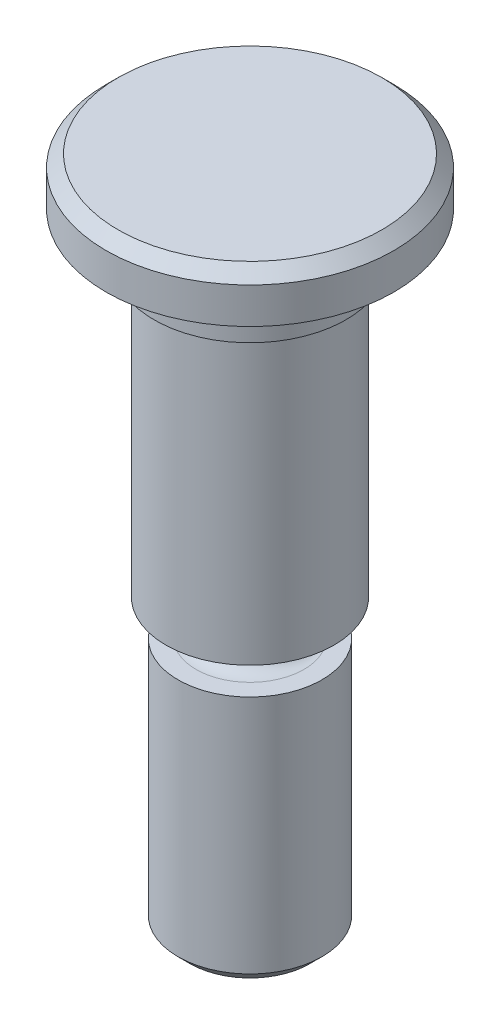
ISO-10303-21;
HEADER;
FILE_DESCRIPTION(('STEP AP214'),'2;1');
FILE_NAME('part.step','',(''),(''),'','','');
FILE_SCHEMA(('AUTOMOTIVE_DESIGN { 1 0 10303 214 1 1 1 1 }'));
ENDSEC;
DATA;
#1=APPLICATION_CONTEXT('core data for automotive mechanical design processes');
#2=APPLICATION_PROTOCOL_DEFINITION('international standard','automotive_design',2000,#1);
#3=PRODUCT_CONTEXT('',#1,'mechanical');
#4=PRODUCT('Part','Part','',(#3));
#5=PRODUCT_RELATED_PRODUCT_CATEGORY('part','',(#4));
#6=PRODUCT_DEFINITION_FORMATION('','',#4);
#7=PRODUCT_DEFINITION_CONTEXT('part definition',#1,'design');
#8=PRODUCT_DEFINITION('design','',#6,#7);
#9=PRODUCT_DEFINITION_SHAPE('','',#8);
#10=(LENGTH_UNIT() NAMED_UNIT(*) SI_UNIT(.MILLI.,.METRE.));
#11=(NAMED_UNIT(*) PLANE_ANGLE_UNIT() SI_UNIT($,.RADIAN.));
#12=(NAMED_UNIT(*) SI_UNIT($,.STERADIAN.) SOLID_ANGLE_UNIT());
#13=UNCERTAINTY_MEASURE_WITH_UNIT(LENGTH_MEASURE(1.E-05),#10,'distance_accuracy_value','');
#14=(GEOMETRIC_REPRESENTATION_CONTEXT(3) GLOBAL_UNCERTAINTY_ASSIGNED_CONTEXT((#13)) GLOBAL_UNIT_ASSIGNED_CONTEXT((#10,
#11,#12)) REPRESENTATION_CONTEXT('',''));
#15=CARTESIAN_POINT('',(0.,0.,0.));
#16=DIRECTION('',(0.,0.,1.));
#17=DIRECTION('',(1.,0.,0.));
#18=AXIS2_PLACEMENT_3D('',#15,#16,#17);
#19=CARTESIAN_POINT('',(0.,28.,-1.2490009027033E-13));
#20=DIRECTION('',(0.,-1.,0.));
#21=DIRECTION('',(0.,0.,-0.999999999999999));
#22=AXIS2_PLACEMENT_3D('',#19,#20,#21);
#23=PLANE('',#22);
#24=CARTESIAN_POINT('',(0.,28.,-1.2490009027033E-13));
#25=DIRECTION('',(0.,-1.,0.));
#26=DIRECTION('',(0.,0.,-0.999999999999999));
#27=AXIS2_PLACEMENT_3D('',#24,#25,#26);
#28=CIRCLE('',#27,5.49999999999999);
#29=CARTESIAN_POINT('',(0.,28.,-5.50000000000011));
#30=VERTEX_POINT('',#29);
#31=EDGE_CURVE('E44',#30,#30,#28,.F.);
#32=ORIENTED_EDGE('',*,*,#31,.T.);
#33=EDGE_LOOP('',(#32));
#34=FACE_BOUND('',#33,.T.);
#35=ADVANCED_FACE('F34',(#34),#23,.F.);
#36=CARTESIAN_POINT('',(0.,0.,0.));
#37=DIRECTION('',(0.,-1.,0.));
#38=DIRECTION('',(0.,0.,-0.999999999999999));
#39=AXIS2_PLACEMENT_3D('',#36,#37,#38);
#40=CYLINDRICAL_SURFACE('',#39,5.99999999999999);
#41=CARTESIAN_POINT('',(0.,27.5,-1.80411241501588E-13));
#42=DIRECTION('',(0.,-1.,0.));
#43=DIRECTION('',(0.,0.,-0.999999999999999));
#44=AXIS2_PLACEMENT_3D('',#41,#42,#43);
#45=CIRCLE('',#44,5.99999999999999);
#46=CARTESIAN_POINT('',(0.,27.5,-6.00000000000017));
#47=VERTEX_POINT('',#46);
#48=EDGE_CURVE('E49',#47,#47,#45,.T.);
#49=ORIENTED_EDGE('',*,*,#48,.T.);
#50=EDGE_LOOP('',(#49));
#51=FACE_BOUND('',#50,.T.);
#52=CARTESIAN_POINT('',(0.,26.,-1.80411241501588E-13));
#53=DIRECTION('',(0.,-1.,0.));
#54=DIRECTION('',(0.,0.,-0.999999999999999));
#55=AXIS2_PLACEMENT_3D('',#52,#53,#54);
#56=CIRCLE('',#55,5.99999999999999);
#57=CARTESIAN_POINT('',(0.,26.,-6.00000000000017));
#58=VERTEX_POINT('',#57);
#59=EDGE_CURVE('E54',#58,#58,#56,.T.);
#60=ORIENTED_EDGE('',*,*,#59,.F.);
#61=EDGE_LOOP('',(#60));
#62=FACE_BOUND('',#61,.T.);
#63=ADVANCED_FACE('F98',(#51,#62),#40,.T.);
#64=CARTESIAN_POINT('',(6.00000000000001,26.,0.));
#65=DIRECTION('',(0.,1.,0.));
#66=DIRECTION('',(0.,0.,0.999999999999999));
#67=AXIS2_PLACEMENT_3D('',#64,#65,#66);
#68=PLANE('',#67);
#69=CARTESIAN_POINT('',(0.,26.,-1.80411241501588E-13));
#70=DIRECTION('',(0.,-1.,0.));
#71=DIRECTION('',(0.,0.,-0.999999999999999));
#72=AXIS2_PLACEMENT_3D('',#69,#70,#71);
#73=CIRCLE('',#72,3.99999999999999);
#74=CARTESIAN_POINT('',(0.,26.,-4.00000000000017));
#75=VERTEX_POINT('',#74);
#76=EDGE_CURVE('E57',#75,#75,#73,.T.);
#77=ORIENTED_EDGE('',*,*,#76,.F.);
#78=EDGE_LOOP('',(#77));
#79=FACE_BOUND('',#78,.T.);
#80=ORIENTED_EDGE('',*,*,#59,.T.);
#81=EDGE_LOOP('',(#80));
#82=FACE_BOUND('',#81,.T.);
#83=ADVANCED_FACE('F103',(#79,#82),#68,.F.);
#84=CARTESIAN_POINT('',(0.,0.,0.));
#85=DIRECTION('',(0.,-1.,0.));
#86=DIRECTION('',(0.,0.,-0.999999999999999));
#87=AXIS2_PLACEMENT_3D('',#84,#85,#86);
#88=CYLINDRICAL_SURFACE('',#87,3.99999999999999);
#89=CARTESIAN_POINT('',(0.,24.,0.));
#90=DIRECTION('',(0.,-1.,0.));
#91=DIRECTION('',(0.,0.,-0.999999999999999));
#92=AXIS2_PLACEMENT_3D('',#89,#90,#91);
#93=CIRCLE('',#92,3.99999999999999);
#94=CARTESIAN_POINT('',(0.,24.,-4.));
#95=VERTEX_POINT('',#94);
#96=EDGE_CURVE('E60',#95,#95,#93,.T.);
#97=ORIENTED_EDGE('',*,*,#96,.F.);
#98=EDGE_LOOP('',(#97));
#99=FACE_BOUND('',#98,.T.);
#100=ORIENTED_EDGE('',*,*,#76,.T.);
#101=EDGE_LOOP('',(#100));
#102=FACE_BOUND('',#101,.T.);
#103=ADVANCED_FACE('F112',(#99,#102),#88,.T.);
#104=CARTESIAN_POINT('',(4.,24.,0.));
#105=DIRECTION('',(0.,1.,0.));
#106=DIRECTION('',(0.,0.,0.999999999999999));
#107=AXIS2_PLACEMENT_3D('',#104,#105,#106);
#108=PLANE('',#107);
#109=CARTESIAN_POINT('',(0.,24.,0.));
#110=DIRECTION('',(0.,-1.,0.));
#111=DIRECTION('',(0.,0.,-0.999999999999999));
#112=AXIS2_PLACEMENT_3D('',#109,#110,#111);
#113=CIRCLE('',#112,3.49999999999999);
#114=CARTESIAN_POINT('',(0.,24.,-3.5));
#115=VERTEX_POINT('',#114);
#116=EDGE_CURVE('E63',#115,#115,#113,.T.);
#117=ORIENTED_EDGE('',*,*,#116,.F.);
#118=EDGE_LOOP('',(#117));
#119=FACE_BOUND('',#118,.T.);
#120=ORIENTED_EDGE('',*,*,#96,.T.);
#121=EDGE_LOOP('',(#120));
#122=FACE_BOUND('',#121,.T.);
#123=ADVANCED_FACE('F93',(#119,#122),#108,.F.);
#124=CARTESIAN_POINT('',(0.,0.,0.));
#125=DIRECTION('',(0.,-1.,0.));
#126=DIRECTION('',(0.,0.,-0.999999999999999));
#127=AXIS2_PLACEMENT_3D('',#124,#125,#126);
#128=CYLINDRICAL_SURFACE('',#127,3.49999999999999);
#129=CARTESIAN_POINT('',(0.,12.,0.));
#130=DIRECTION('',(0.,-1.,0.));
#131=DIRECTION('',(0.,0.,-0.999999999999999));
#132=AXIS2_PLACEMENT_3D('',#129,#130,#131);
#133=CIRCLE('',#132,3.49999999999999);
#134=CARTESIAN_POINT('',(0.,12.,-3.49999999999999));
#135=VERTEX_POINT('',#134);
#136=EDGE_CURVE('E66',#135,#135,#133,.T.);
#137=ORIENTED_EDGE('',*,*,#136,.F.);
#138=EDGE_LOOP('',(#137));
#139=FACE_BOUND('',#138,.T.);
#140=ORIENTED_EDGE('',*,*,#116,.T.);
#141=EDGE_LOOP('',(#140));
#142=FACE_BOUND('',#141,.T.);
#143=ADVANCED_FACE('F84',(#139,#142),#128,.T.);
#144=CARTESIAN_POINT('',(3.49999999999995,12.,0.));
#145=DIRECTION('',(0.,1.,0.));
#146=DIRECTION('',(0.,0.,0.999999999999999));
#147=AXIS2_PLACEMENT_3D('',#144,#145,#146);
#148=PLANE('',#147);
#149=ORIENTED_EDGE('',*,*,#136,.T.);
#150=EDGE_LOOP('',(#149));
#151=FACE_BOUND('',#150,.T.);
#152=CARTESIAN_POINT('',(0.,12.,0.));
#153=DIRECTION('',(0.,-1.,0.));
#154=DIRECTION('',(0.,0.,-0.999999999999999));
#155=AXIS2_PLACEMENT_3D('',#152,#153,#154);
#156=CIRCLE('',#155,2.25);
#157=CARTESIAN_POINT('',(0.,12.,-2.25));
#158=VERTEX_POINT('',#157);
#159=EDGE_CURVE('E75',#158,#158,#156,.T.);
#160=ORIENTED_EDGE('',*,*,#159,.F.);
#161=EDGE_LOOP('',(#160));
#162=FACE_BOUND('',#161,.T.);
#163=ADVANCED_FACE('F81',(#151,#162),#148,.F.);
#164=CARTESIAN_POINT('',(0.,27.5,-1.80411241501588E-13));
#165=DIRECTION('',(0.,-1.,0.));
#166=DIRECTION('',(0.,0.,-0.999999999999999));
#167=AXIS2_PLACEMENT_3D('',#164,#165,#166);
#168=CONICAL_SURFACE('',#167,5.99999999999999,0.785398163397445);
#169=ORIENTED_EDGE('',*,*,#31,.F.);
#170=EDGE_LOOP('',(#169));
#171=FACE_BOUND('',#170,.T.);
#172=ORIENTED_EDGE('',*,*,#48,.F.);
#173=EDGE_LOOP('',(#172));
#174=FACE_BOUND('',#173,.T.);
#175=ADVANCED_FACE('F83',(#171,#174),#168,.T.);
#176=CARTESIAN_POINT('',(0.,11.25,0.));
#177=DIRECTION('',(0.,-1.,0.));
#178=DIRECTION('',(0.,0.,-0.999999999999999));
#179=AXIS2_PLACEMENT_3D('',#176,#177,#178);
#180=TOROIDAL_SURFACE('',#179,2.25,0.75);
#181=CARTESIAN_POINT('',(0.,10.5,0.));
#182=DIRECTION('',(0.,-1.,0.));
#183=DIRECTION('',(0.,0.,-0.999999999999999));
#184=AXIS2_PLACEMENT_3D('',#181,#182,#183);
#185=CIRCLE('',#184,2.25);
#186=CARTESIAN_POINT('',(0.,10.5,-2.25));
#187=VERTEX_POINT('',#186);
#188=EDGE_CURVE('E69',#187,#187,#185,.T.);
#189=ORIENTED_EDGE('',*,*,#188,.F.);
#190=EDGE_LOOP('',(#189));
#191=FACE_BOUND('',#190,.T.);
#192=ORIENTED_EDGE('',*,*,#159,.T.);
#193=EDGE_LOOP('',(#192));
#194=FACE_BOUND('',#193,.T.);
#195=ADVANCED_FACE('F79',(#191,#194),#180,.F.);
#196=CARTESIAN_POINT('',(0.,10.5,-3.));
#197=DIRECTION('',(0.,1.,0.));
#198=DIRECTION('',(0.,0.,0.999999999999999));
#199=AXIS2_PLACEMENT_3D('',#196,#197,#198);
#200=PLANE('',#199);
#201=ORIENTED_EDGE('',*,*,#188,.T.);
#202=EDGE_LOOP('',(#201));
#203=FACE_BOUND('',#202,.T.);
#204=CARTESIAN_POINT('',(0.,10.5,0.));
#205=DIRECTION('',(0.,-1.,0.));
#206=DIRECTION('',(0.,0.,-0.999999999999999));
#207=AXIS2_PLACEMENT_3D('',#204,#205,#206);
#208=CIRCLE('',#207,3.);
#209=CARTESIAN_POINT('',(0.,10.5,-3.));
#210=VERTEX_POINT('',#209);
#211=EDGE_CURVE('E72',#210,#210,#208,.T.);
#212=ORIENTED_EDGE('',*,*,#211,.F.);
#213=EDGE_LOOP('',(#212));
#214=FACE_BOUND('',#213,.T.);
#215=ADVANCED_FACE('F172',(#203,#214),#200,.T.);
#216=CARTESIAN_POINT('',(3.,0.,0.));
#217=DIRECTION('',(0.,1.,0.));
#218=DIRECTION('',(0.,0.,0.999999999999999));
#219=AXIS2_PLACEMENT_3D('',#216,#217,#218);
#220=PLANE('',#219);
#221=CARTESIAN_POINT('',(0.,0.,0.));
#222=DIRECTION('',(0.,1.,0.));
#223=DIRECTION('',(0.,0.,0.999999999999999));
#224=AXIS2_PLACEMENT_3D('',#221,#222,#223);
#225=CIRCLE('',#224,2.49999999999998);
#226=CARTESIAN_POINT('',(0.,0.,2.49999999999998));
#227=VERTEX_POINT('',#226);
#228=EDGE_CURVE('E40',#227,#227,#225,.F.);
#229=ORIENTED_EDGE('',*,*,#228,.T.);
#230=EDGE_LOOP('',(#229));
#231=FACE_BOUND('',#230,.T.);
#232=ADVANCED_FACE('F164',(#231),#220,.F.);
#233=CARTESIAN_POINT('',(0.,0.,0.));
#234=DIRECTION('',(0.,1.,0.));
#235=DIRECTION('',(0.,0.,0.999999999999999));
#236=AXIS2_PLACEMENT_3D('',#233,#234,#235);
#237=CONICAL_SURFACE('',#236,2.49999999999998,0.785398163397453);
#238=CARTESIAN_POINT('',(0.,0.5,0.));
#239=DIRECTION('',(0.,1.,0.));
#240=DIRECTION('',(0.,0.,0.999999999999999));
#241=AXIS2_PLACEMENT_3D('',#238,#239,#240);
#242=CIRCLE('',#241,2.99999999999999);
#243=CARTESIAN_POINT('',(0.,0.5,2.99999999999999));
#244=VERTEX_POINT('',#243);
#245=EDGE_CURVE('E10',#244,#244,#242,.T.);
#246=ORIENTED_EDGE('',*,*,#245,.F.);
#247=EDGE_LOOP('',(#246));
#248=FACE_BOUND('',#247,.T.);
#249=ORIENTED_EDGE('',*,*,#228,.F.);
#250=EDGE_LOOP('',(#249));
#251=FACE_BOUND('',#250,.T.);
#252=ADVANCED_FACE('F155',(#248,#251),#237,.T.);
#253=CARTESIAN_POINT('',(0.,0.,0.));
#254=DIRECTION('',(0.,-1.,0.));
#255=DIRECTION('',(0.,0.,-0.999999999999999));
#256=AXIS2_PLACEMENT_3D('',#253,#254,#255);
#257=CYLINDRICAL_SURFACE('',#256,2.99999999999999);
#258=ORIENTED_EDGE('',*,*,#245,.T.);
#259=EDGE_LOOP('',(#258));
#260=FACE_BOUND('',#259,.T.);
#261=ORIENTED_EDGE('',*,*,#211,.T.);
#262=EDGE_LOOP('',(#261));
#263=FACE_BOUND('',#262,.T.);
#264=ADVANCED_FACE('F151',(#260,#263),#257,.T.);
#265=CLOSED_SHELL('',(#35,#63,#83,#103,#123,#143,#163,#175,#195,#215,#232,#252,#264));
#266=MANIFOLD_SOLID_BREP('B2',#265);
#267=ADVANCED_BREP_SHAPE_REPRESENTATION('',(#18,#266),#14);
#268=SHAPE_DEFINITION_REPRESENTATION(#9,#267);
ENDSEC;
END-ISO-10303-21;
